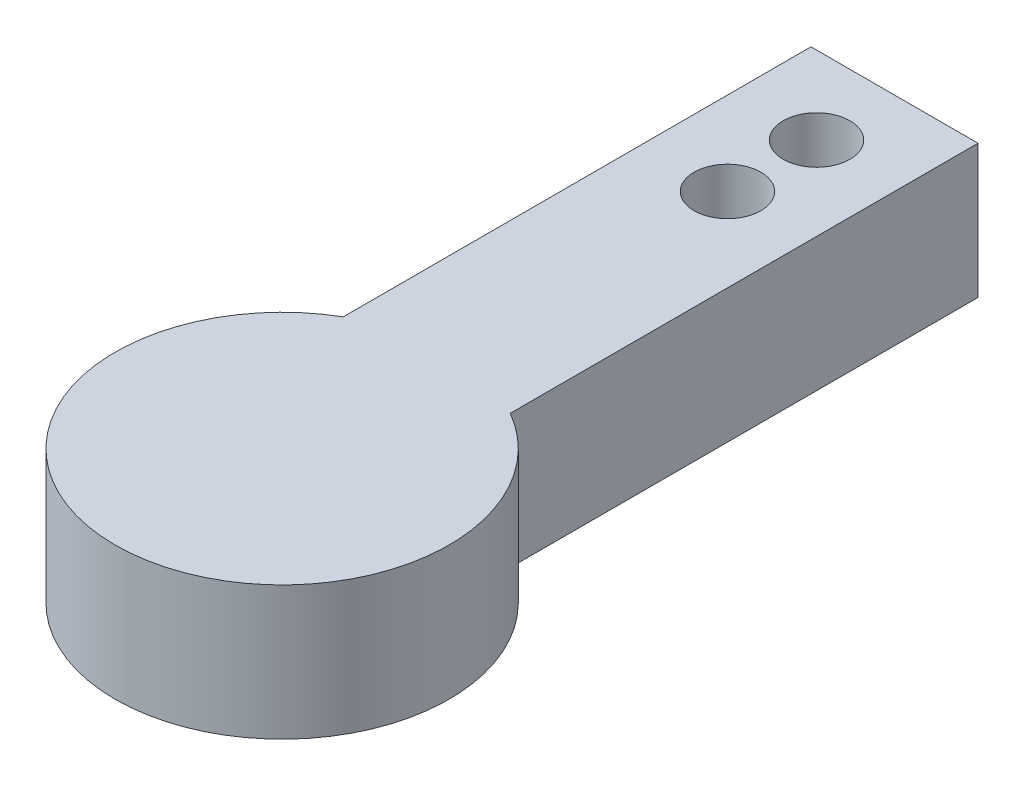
from build123d import *

# Parameters (mm, degrees)
SKETCH1_W           = 7.5
SKETCH1_H           = 20
SKETCH1_R           = 7.5
BOSS_EXTRUDE1_DEPTH = 6
SKETCH2_R           = 3
SKETCH2_R_2         = 1.5
CUT_EXTRUDE1_DEPTH  = 30.129023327
BOSS_EXTRUDE2_START = -1
SKETCH3_R           = 3
BOSS_EXTRUDE2_DEPTH = 1


with BuildPart() as part:
    # Sketch1 → Boss-Extrude1 (new body)
    with BuildSketch(Plane(origin=(0, 0, 0), x_dir=(1, 0, 0), z_dir=(0, 1, 0))):
        with Locations((0, 17.5)):
            Rectangle(SKETCH1_W, SKETCH1_H)
        with BuildLine():
            Line((3.75, 7.5), (0, 7.5))
            ThreePointArc((0, 7.5), (1.941142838, 7.244443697), (3.75, 6.495190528))
            Line((3.75, 6.495190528), (3.75, 7.5))
        make_face()
        with BuildLine():
            Line((0, 7.5), (-3.75, 7.5))
            Line((-3.75, 7.5), (-3.75, 6.495190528))
            ThreePointArc((-3.75, 6.495190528), (-1.941142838, 7.244443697), (0, 7.5))
        make_face()
        Circle(SKETCH1_R)
    extrude(amount=BOSS_EXTRUDE1_DEPTH)

    # Sketch2 → Cut-Extrude1 (cut, through all)
    with BuildSketch(Plane.XZ):
        with Locations(Location((0, 0, 0), (0, 0, 270))):
            Circle(SKETCH2_R)
        with Locations(Location((0, -20, 0), (0, 0, 270))):
            Circle(SKETCH2_R_2)
        with Locations(Location((0, -24, 0), (0, 0, 270))):
            Circle(SKETCH2_R_2)
    extrude(amount=-CUT_EXTRUDE1_DEPTH, mode=Mode.SUBTRACT)

    # Sketch3 → Boss-Extrude2 (add)
    with BuildSketch(Plane(origin=(0, 6, 0), x_dir=(1, 0, 0), z_dir=(0, 1, 0)).offset(BOSS_EXTRUDE2_START)):
        with Locations(Location((0, 0, 0), (0, 0, 90))):
            Circle(SKETCH3_R)
    extrude(amount=BOSS_EXTRUDE2_DEPTH)


solid = part.part
